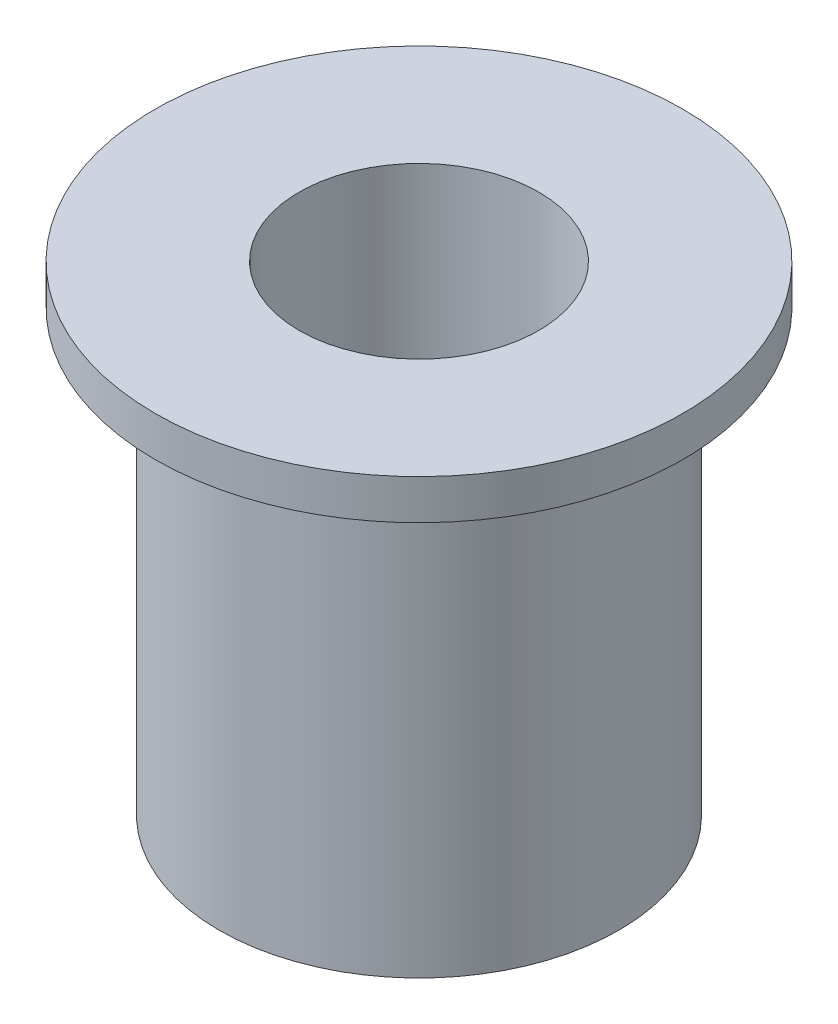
from build123d import *

# Parameters (mm, degrees)
SKETCH1_R      = 7.9375
SKETCH1_R_2    = 4.7625
EXTRUDE1_DEPTH = 17.4625
SKETCH2_R      = 10.4775
SKETCH2_R_2    = 4.7625
EXTRUDE2_DEPTH = 1.5875


with BuildPart() as part:
    # Sketch1 → Extrude1 (new body)
    with BuildSketch(Plane(origin=(0, 0, 0), x_dir=(1, 0, 0), z_dir=(0, 1, 0))):
        with Locations(Location((0, 0, 0), (0, 0, 270))):
            Circle(SKETCH1_R)
        with Locations(Location((0, 0, 0), (0, 0, 270))):
            Circle(SKETCH1_R_2, mode=Mode.SUBTRACT)
    extrude(amount=EXTRUDE1_DEPTH)

    # Sketch2 → Extrude2 (add)
    with BuildSketch(Plane(origin=(0, 17.4625, 0), x_dir=(-1, 0, 0), z_dir=(0, 1, 0))):
        with Locations(Location((0, 0, 0), (0, 0, 90))):
            Circle(SKETCH2_R)
        with Locations(Location((0, 0, 0), (0, 0, 90))):
            Circle(SKETCH2_R_2, mode=Mode.SUBTRACT)
    extrude(amount=EXTRUDE2_DEPTH)


solid = part.part
